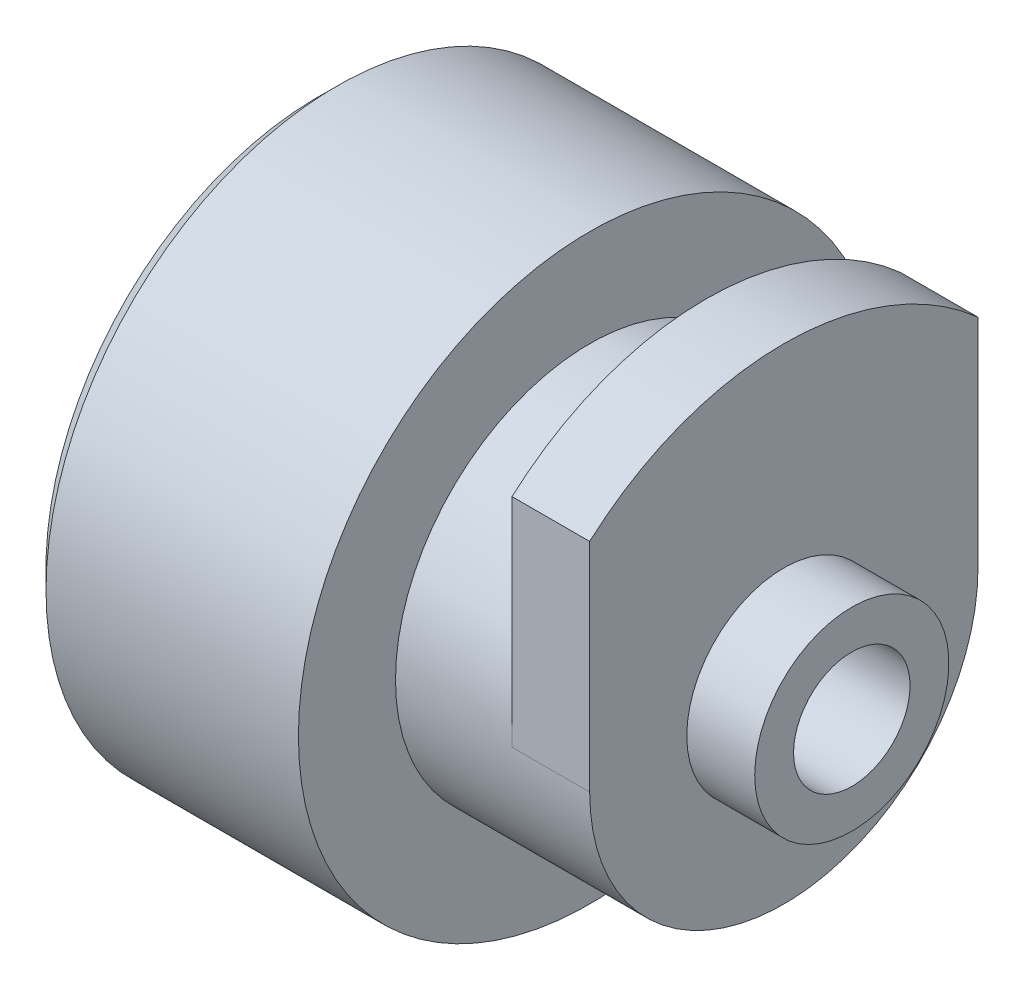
ISO-10303-21;
HEADER;
FILE_DESCRIPTION(('STEP AP214'),'2;1');
FILE_NAME('part.step','',(''),(''),'','','');
FILE_SCHEMA(('AUTOMOTIVE_DESIGN { 1 0 10303 214 1 1 1 1 }'));
ENDSEC;
DATA;
#1=APPLICATION_CONTEXT('core data for automotive mechanical design processes');
#2=APPLICATION_PROTOCOL_DEFINITION('international standard','automotive_design',2000,#1);
#3=PRODUCT_CONTEXT('',#1,'mechanical');
#4=PRODUCT('Part','Part','',(#3));
#5=PRODUCT_RELATED_PRODUCT_CATEGORY('part','',(#4));
#6=PRODUCT_DEFINITION_FORMATION('','',#4);
#7=PRODUCT_DEFINITION_CONTEXT('part definition',#1,'design');
#8=PRODUCT_DEFINITION('design','',#6,#7);
#9=PRODUCT_DEFINITION_SHAPE('','',#8);
#10=(LENGTH_UNIT() NAMED_UNIT(*) SI_UNIT(.MILLI.,.METRE.));
#11=(NAMED_UNIT(*) PLANE_ANGLE_UNIT() SI_UNIT($,.RADIAN.));
#12=(NAMED_UNIT(*) SI_UNIT($,.STERADIAN.) SOLID_ANGLE_UNIT());
#13=UNCERTAINTY_MEASURE_WITH_UNIT(LENGTH_MEASURE(1.E-05),#10,'distance_accuracy_value','');
#14=(GEOMETRIC_REPRESENTATION_CONTEXT(3) GLOBAL_UNCERTAINTY_ASSIGNED_CONTEXT((#13)) GLOBAL_UNIT_ASSIGNED_CONTEXT((#10,
#11,#12)) REPRESENTATION_CONTEXT('',''));
#15=CARTESIAN_POINT('',(0.,0.,0.));
#16=DIRECTION('',(0.,0.,1.));
#17=DIRECTION('',(1.,0.,0.));
#18=AXIS2_PLACEMENT_3D('',#15,#16,#17);
#19=CARTESIAN_POINT('',(0.,0.,-15.));
#20=DIRECTION('',(1.,0.,0.));
#21=DIRECTION('',(0.,0.,-1.));
#22=AXIS2_PLACEMENT_3D('',#19,#20,#21);
#23=PLANE('',#22);
#24=CARTESIAN_POINT('',(0.,0.,0.));
#25=DIRECTION('',(1.,0.,0.));
#26=DIRECTION('',(0.,0.,-1.));
#27=AXIS2_PLACEMENT_3D('',#24,#25,#26);
#28=CIRCLE('',#27,14.);
#29=CARTESIAN_POINT('',(0.,0.,-14.));
#30=VERTEX_POINT('',#29);
#31=EDGE_CURVE('E37',#30,#30,#28,.F.);
#32=ORIENTED_EDGE('',*,*,#31,.T.);
#33=EDGE_LOOP('',(#32));
#34=FACE_BOUND('',#33,.T.);
#35=CARTESIAN_POINT('',(0.,0.,0.));
#36=DIRECTION('',(-1.,0.,0.));
#37=DIRECTION('',(0.,0.,1.));
#38=AXIS2_PLACEMENT_3D('',#35,#36,#37);
#39=CIRCLE('',#38,10.);
#40=CARTESIAN_POINT('',(0.,0.,10.));
#41=VERTEX_POINT('',#40);
#42=EDGE_CURVE('E112',#41,#41,#39,.T.);
#43=ORIENTED_EDGE('',*,*,#42,.F.);
#44=EDGE_LOOP('',(#43));
#45=FACE_BOUND('',#44,.T.);
#46=ADVANCED_FACE('F30',(#34,#45),#23,.F.);
#47=CARTESIAN_POINT('',(0.,0.,0.));
#48=DIRECTION('',(-1.,0.,0.));
#49=DIRECTION('',(0.,0.,1.));
#50=AXIS2_PLACEMENT_3D('',#47,#48,#49);
#51=CYLINDRICAL_SURFACE('',#50,15.);
#52=CARTESIAN_POINT('',(1.00000000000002,0.,0.));
#53=DIRECTION('',(1.,0.,0.));
#54=DIRECTION('',(0.,0.,-1.));
#55=AXIS2_PLACEMENT_3D('',#52,#53,#54);
#56=CIRCLE('',#55,15.);
#57=CARTESIAN_POINT('',(1.00000000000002,0.,-15.));
#58=VERTEX_POINT('',#57);
#59=EDGE_CURVE('E11',#58,#58,#56,.T.);
#60=ORIENTED_EDGE('',*,*,#59,.T.);
#61=EDGE_LOOP('',(#60));
#62=FACE_BOUND('',#61,.T.);
#63=CARTESIAN_POINT('',(14.,0.,0.));
#64=DIRECTION('',(-1.,0.,0.));
#65=DIRECTION('',(0.,0.,1.));
#66=AXIS2_PLACEMENT_3D('',#63,#64,#65);
#67=CIRCLE('',#66,15.);
#68=CARTESIAN_POINT('',(14.,0.,15.));
#69=VERTEX_POINT('',#68);
#70=EDGE_CURVE('E125',#69,#69,#67,.T.);
#71=ORIENTED_EDGE('',*,*,#70,.T.);
#72=EDGE_LOOP('',(#71));
#73=FACE_BOUND('',#72,.T.);
#74=ADVANCED_FACE('F151',(#62,#73),#51,.T.);
#75=CARTESIAN_POINT('',(14.,0.,-9.99999999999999));
#76=DIRECTION('',(-1.,0.,0.));
#77=DIRECTION('',(0.,0.,1.));
#78=AXIS2_PLACEMENT_3D('',#75,#76,#77);
#79=PLANE('',#78);
#80=ORIENTED_EDGE('',*,*,#70,.F.);
#81=EDGE_LOOP('',(#80));
#82=FACE_BOUND('',#81,.T.);
#83=CARTESIAN_POINT('',(14.,0.,0.));
#84=DIRECTION('',(-1.,0.,0.));
#85=DIRECTION('',(0.,0.,1.));
#86=AXIS2_PLACEMENT_3D('',#83,#84,#85);
#87=CIRCLE('',#86,9.99999999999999);
#88=CARTESIAN_POINT('',(14.,0.,9.99999999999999));
#89=VERTEX_POINT('',#88);
#90=EDGE_CURVE('E77',#89,#89,#87,.T.);
#91=ORIENTED_EDGE('',*,*,#90,.T.);
#92=EDGE_LOOP('',(#91));
#93=FACE_BOUND('',#92,.T.);
#94=ADVANCED_FACE('F155',(#82,#93),#79,.F.);
#95=CARTESIAN_POINT('',(0.,0.,0.));
#96=DIRECTION('',(-1.,0.,0.));
#97=DIRECTION('',(0.,0.,1.));
#98=AXIS2_PLACEMENT_3D('',#95,#96,#97);
#99=CYLINDRICAL_SURFACE('',#98,9.99999999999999);
#100=ORIENTED_EDGE('',*,*,#90,.F.);
#101=EDGE_LOOP('',(#100));
#102=FACE_BOUND('',#101,.T.);
#103=CARTESIAN_POINT('',(20.,0.,0.));
#104=DIRECTION('',(1.,0.,0.));
#105=DIRECTION('',(0.,0.,-1.));
#106=AXIS2_PLACEMENT_3D('',#103,#104,#105);
#107=CIRCLE('',#106,9.99999999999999);
#108=CARTESIAN_POINT('',(20.,0.,-9.99999999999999));
#109=VERTEX_POINT('',#108);
#110=CARTESIAN_POINT('',(20.,0.,9.99999999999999));
#111=VERTEX_POINT('',#110);
#112=EDGE_CURVE('E48',#109,#111,#107,.T.);
#113=ORIENTED_EDGE('',*,*,#112,.F.);
#114=DIRECTION('',(1.,0.,0.));
#115=VECTOR('',#114,1.);
#116=CARTESIAN_POINT('',(20.,0.,-9.99999999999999));
#117=LINE('',#116,#115);
#118=CARTESIAN_POINT('',(24.,0.,-9.99999999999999));
#119=VERTEX_POINT('',#118);
#120=EDGE_CURVE('E80',#109,#119,#117,.T.);
#121=ORIENTED_EDGE('',*,*,#120,.T.);
#122=CARTESIAN_POINT('',(24.,0.,0.));
#123=DIRECTION('',(-1.,0.,0.));
#124=DIRECTION('',(0.,0.,1.));
#125=AXIS2_PLACEMENT_3D('',#122,#123,#124);
#126=CIRCLE('',#125,9.99999999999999);
#127=CARTESIAN_POINT('',(24.,0.,9.99999999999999));
#128=VERTEX_POINT('',#127);
#129=EDGE_CURVE('E69',#119,#128,#126,.T.);
#130=ORIENTED_EDGE('',*,*,#129,.T.);
#131=DIRECTION('',(1.,0.,0.));
#132=VECTOR('',#131,1.);
#133=CARTESIAN_POINT('',(20.,0.,9.99999999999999));
#134=LINE('',#133,#132);
#135=EDGE_CURVE('E44',#111,#128,#134,.T.);
#136=ORIENTED_EDGE('',*,*,#135,.F.);
#137=EDGE_LOOP('',(#113,#121,#130,#136));
#138=FACE_BOUND('',#137,.T.);
#139=ADVANCED_FACE('F81',(#102,#138),#99,.T.);
#140=CARTESIAN_POINT('',(24.,0.,-4.99999999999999));
#141=DIRECTION('',(-1.,0.,0.));
#142=DIRECTION('',(0.,0.,1.));
#143=AXIS2_PLACEMENT_3D('',#140,#141,#142);
#144=PLANE('',#143);
#145=CARTESIAN_POINT('',(24.,0.,0.));
#146=DIRECTION('',(-1.,0.,0.));
#147=DIRECTION('',(0.,0.,1.));
#148=AXIS2_PLACEMENT_3D('',#145,#146,#147);
#149=CIRCLE('',#148,4.99999999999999);
#150=CARTESIAN_POINT('',(24.,0.,4.99999999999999));
#151=VERTEX_POINT('',#150);
#152=EDGE_CURVE('E78',#151,#151,#149,.T.);
#153=ORIENTED_EDGE('',*,*,#152,.T.);
#154=EDGE_LOOP('',(#153));
#155=FACE_BOUND('',#154,.T.);
#156=ORIENTED_EDGE('',*,*,#129,.F.);
#157=DIRECTION('',(0.,1.,0.));
#158=VECTOR('',#157,1.);
#159=CARTESIAN_POINT('',(24.,0.,-9.99999999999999));
#160=LINE('',#159,#158);
#161=CARTESIAN_POINT('',(24.,11.180339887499,-9.99999999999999));
#162=VERTEX_POINT('',#161);
#163=EDGE_CURVE('E73',#119,#162,#160,.T.);
#164=ORIENTED_EDGE('',*,*,#163,.T.);
#165=CARTESIAN_POINT('',(24.,0.,0.));
#166=DIRECTION('',(1.,0.,0.));
#167=DIRECTION('',(0.,0.,-1.));
#168=AXIS2_PLACEMENT_3D('',#165,#166,#167);
#169=CIRCLE('',#168,15.);
#170=CARTESIAN_POINT('',(24.,11.1803398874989,9.99999999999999));
#171=VERTEX_POINT('',#170);
#172=EDGE_CURVE('E88',#162,#171,#169,.T.);
#173=ORIENTED_EDGE('',*,*,#172,.T.);
#174=DIRECTION('',(0.,-1.,0.));
#175=VECTOR('',#174,1.);
#176=CARTESIAN_POINT('',(24.,0.,9.99999999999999));
#177=LINE('',#176,#175);
#178=EDGE_CURVE('E76',#171,#128,#177,.T.);
#179=ORIENTED_EDGE('',*,*,#178,.T.);
#180=EDGE_LOOP('',(#156,#164,#173,#179));
#181=FACE_BOUND('',#180,.T.);
#182=ADVANCED_FACE('F70',(#155,#181),#144,.F.);
#183=CARTESIAN_POINT('',(0.,0.,0.));
#184=DIRECTION('',(-1.,0.,0.));
#185=DIRECTION('',(0.,0.,1.));
#186=AXIS2_PLACEMENT_3D('',#183,#184,#185);
#187=CYLINDRICAL_SURFACE('',#186,4.99999999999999);
#188=ORIENTED_EDGE('',*,*,#152,.F.);
#189=EDGE_LOOP('',(#188));
#190=FACE_BOUND('',#189,.T.);
#191=CARTESIAN_POINT('',(27.5,0.,0.));
#192=DIRECTION('',(-1.,0.,0.));
#193=DIRECTION('',(0.,0.,1.));
#194=AXIS2_PLACEMENT_3D('',#191,#192,#193);
#195=CIRCLE('',#194,4.99999999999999);
#196=CARTESIAN_POINT('',(27.5,0.,4.99999999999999));
#197=VERTEX_POINT('',#196);
#198=EDGE_CURVE('E118',#197,#197,#195,.T.);
#199=ORIENTED_EDGE('',*,*,#198,.T.);
#200=EDGE_LOOP('',(#199));
#201=FACE_BOUND('',#200,.T.);
#202=ADVANCED_FACE('F169',(#190,#201),#187,.T.);
#203=CARTESIAN_POINT('',(27.5,0.,0.));
#204=DIRECTION('',(-1.,0.,0.));
#205=DIRECTION('',(0.,0.,1.));
#206=AXIS2_PLACEMENT_3D('',#203,#204,#205);
#207=PLANE('',#206);
#208=CARTESIAN_POINT('',(27.5,0.,0.));
#209=DIRECTION('',(-1.,0.,0.));
#210=DIRECTION('',(0.,0.,1.));
#211=AXIS2_PLACEMENT_3D('',#208,#209,#210);
#212=CIRCLE('',#211,3.);
#213=CARTESIAN_POINT('',(27.5,0.,3.));
#214=VERTEX_POINT('',#213);
#215=EDGE_CURVE('E109',#214,#214,#212,.T.);
#216=ORIENTED_EDGE('',*,*,#215,.T.);
#217=EDGE_LOOP('',(#216));
#218=FACE_BOUND('',#217,.T.);
#219=ORIENTED_EDGE('',*,*,#198,.F.);
#220=EDGE_LOOP('',(#219));
#221=FACE_BOUND('',#220,.T.);
#222=ADVANCED_FACE('F173',(#218,#221),#207,.F.);
#223=CARTESIAN_POINT('',(5.,0.,0.));
#224=DIRECTION('',(-1.,0.,0.));
#225=DIRECTION('',(0.,0.,1.));
#226=AXIS2_PLACEMENT_3D('',#223,#224,#225);
#227=CYLINDRICAL_SURFACE('',#226,10.);
#228=CARTESIAN_POINT('',(5.,0.,0.));
#229=DIRECTION('',(-1.,0.,0.));
#230=DIRECTION('',(0.,0.,1.));
#231=AXIS2_PLACEMENT_3D('',#228,#229,#230);
#232=CIRCLE('',#231,10.);
#233=CARTESIAN_POINT('',(5.,0.,10.));
#234=VERTEX_POINT('',#233);
#235=EDGE_CURVE('E115',#234,#234,#232,.T.);
#236=ORIENTED_EDGE('',*,*,#235,.F.);
#237=EDGE_LOOP('',(#236));
#238=FACE_BOUND('',#237,.T.);
#239=ORIENTED_EDGE('',*,*,#42,.T.);
#240=EDGE_LOOP('',(#239));
#241=FACE_BOUND('',#240,.T.);
#242=ADVANCED_FACE('F177',(#238,#241),#227,.F.);
#243=CARTESIAN_POINT('',(5.,0.,0.));
#244=DIRECTION('',(-1.,0.,0.));
#245=DIRECTION('',(0.,0.,1.));
#246=AXIS2_PLACEMENT_3D('',#243,#244,#245);
#247=PLANE('',#246);
#248=CARTESIAN_POINT('',(5.,0.,0.));
#249=DIRECTION('',(-1.,0.,0.));
#250=DIRECTION('',(0.,0.,1.));
#251=AXIS2_PLACEMENT_3D('',#248,#249,#250);
#252=CIRCLE('',#251,3.);
#253=CARTESIAN_POINT('',(5.,0.,3.));
#254=VERTEX_POINT('',#253);
#255=EDGE_CURVE('E106',#254,#254,#252,.T.);
#256=ORIENTED_EDGE('',*,*,#255,.F.);
#257=EDGE_LOOP('',(#256));
#258=FACE_BOUND('',#257,.T.);
#259=ORIENTED_EDGE('',*,*,#235,.T.);
#260=EDGE_LOOP('',(#259));
#261=FACE_BOUND('',#260,.T.);
#262=ADVANCED_FACE('F145',(#258,#261),#247,.T.);
#263=CARTESIAN_POINT('',(27.5,0.,0.));
#264=DIRECTION('',(-1.,0.,0.));
#265=DIRECTION('',(0.,0.,1.));
#266=AXIS2_PLACEMENT_3D('',#263,#264,#265);
#267=CYLINDRICAL_SURFACE('',#266,3.);
#268=CARTESIAN_POINT('',(5.,0.,3.));
#269=CARTESIAN_POINT('',(5.234375,0.,3.));
#270=CARTESIAN_POINT('',(5.46875,0.,3.));
#271=CARTESIAN_POINT('',(5.9375,0.,3.));
#272=CARTESIAN_POINT('',(6.171875,0.,3.));
#273=CARTESIAN_POINT('',(6.640625,0.,3.));
#274=CARTESIAN_POINT('',(6.875,0.,3.));
#275=CARTESIAN_POINT('',(7.34375,0.,3.));
#276=CARTESIAN_POINT('',(7.578125,0.,3.));
#277=CARTESIAN_POINT('',(8.046875,0.,3.));
#278=CARTESIAN_POINT('',(8.28125,0.,3.));
#279=CARTESIAN_POINT('',(8.75,0.,3.));
#280=CARTESIAN_POINT('',(8.984375,0.,3.));
#281=CARTESIAN_POINT('',(9.453125,0.,3.));
#282=CARTESIAN_POINT('',(9.6875,0.,3.));
#283=CARTESIAN_POINT('',(10.15625,0.,3.));
#284=CARTESIAN_POINT('',(10.390625,0.,3.));
#285=CARTESIAN_POINT('',(10.859375,0.,3.));
#286=CARTESIAN_POINT('',(11.09375,0.,3.));
#287=CARTESIAN_POINT('',(11.5625,0.,3.));
#288=CARTESIAN_POINT('',(11.796875,0.,3.));
#289=CARTESIAN_POINT('',(12.265625,0.,3.));
#290=CARTESIAN_POINT('',(12.5,0.,3.));
#291=CARTESIAN_POINT('',(12.96875,0.,3.));
#292=CARTESIAN_POINT('',(13.203125,0.,3.));
#293=CARTESIAN_POINT('',(13.671875,0.,3.));
#294=CARTESIAN_POINT('',(13.90625,0.,3.));
#295=CARTESIAN_POINT('',(14.375,0.,3.));
#296=CARTESIAN_POINT('',(14.609375,0.,3.));
#297=CARTESIAN_POINT('',(15.078125,0.,3.));
#298=CARTESIAN_POINT('',(15.3125,0.,3.));
#299=CARTESIAN_POINT('',(15.78125,0.,3.));
#300=CARTESIAN_POINT('',(16.015625,0.,3.));
#301=CARTESIAN_POINT('',(16.484375,0.,3.));
#302=CARTESIAN_POINT('',(16.71875,0.,3.));
#303=CARTESIAN_POINT('',(17.1875,0.,3.));
#304=CARTESIAN_POINT('',(17.421875,0.,3.));
#305=CARTESIAN_POINT('',(17.890625,0.,3.));
#306=CARTESIAN_POINT('',(18.125,0.,3.));
#307=CARTESIAN_POINT('',(18.59375,0.,3.));
#308=CARTESIAN_POINT('',(18.828125,0.,3.));
#309=CARTESIAN_POINT('',(19.296875,0.,3.));
#310=CARTESIAN_POINT('',(19.53125,0.,3.));
#311=CARTESIAN_POINT('',(20.,0.,3.));
#312=CARTESIAN_POINT('',(20.234375,0.,3.));
#313=CARTESIAN_POINT('',(20.703125,0.,3.));
#314=CARTESIAN_POINT('',(20.9375,0.,3.));
#315=CARTESIAN_POINT('',(21.40625,0.,3.));
#316=CARTESIAN_POINT('',(21.640625,0.,3.));
#317=CARTESIAN_POINT('',(22.109375,0.,3.));
#318=CARTESIAN_POINT('',(22.34375,0.,3.));
#319=CARTESIAN_POINT('',(22.8125,0.,3.));
#320=CARTESIAN_POINT('',(23.046875,0.,3.));
#321=CARTESIAN_POINT('',(23.515625,0.,3.));
#322=CARTESIAN_POINT('',(23.75,0.,3.));
#323=CARTESIAN_POINT('',(24.21875,0.,3.));
#324=CARTESIAN_POINT('',(24.453125,0.,3.));
#325=CARTESIAN_POINT('',(24.921875,0.,3.));
#326=CARTESIAN_POINT('',(25.15625,0.,3.));
#327=CARTESIAN_POINT('',(25.625,0.,3.));
#328=CARTESIAN_POINT('',(25.859375,0.,3.));
#329=CARTESIAN_POINT('',(26.328125,0.,3.));
#330=CARTESIAN_POINT('',(26.5625,0.,3.));
#331=CARTESIAN_POINT('',(27.03125,0.,3.));
#332=CARTESIAN_POINT('',(27.265625,0.,3.));
#333=CARTESIAN_POINT('',(27.5,0.,3.));
#334=B_SPLINE_CURVE_WITH_KNOTS('',3,(#268,#269,#270,#271,#272,#273,#274,#275,#276,#277,#278,
#279,#280,#281,#282,#283,#284,#285,#286,#287,#288,#289,#290,#291,#292,#293,#294,#295,#296,#297,
#298,#299,#300,#301,#302,#303,#304,#305,#306,#307,#308,#309,#310,#311,#312,#313,#314,#315,#316,
#317,#318,#319,#320,#321,#322,#323,#324,#325,#326,#327,#328,#329,#330,#331,#332,#333),
.UNSPECIFIED.,.F.,.F.,(4,2,2,2,2,2,2,2,2,2,2,2,2,2,2,2,2,2,2,2,2,2,2,2,2,2,2,2,2,2,2,2,4),(0.,
0.703124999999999,1.40625,2.109375,2.8125,3.515625,4.21875,4.921875,5.625,6.328125,7.03125,
7.734375,8.4375,9.140625,9.84375,10.546875,11.25,11.953125,12.65625,13.359375,14.0625,14.765625,
15.46875,16.171875,16.875,17.578125,18.28125,18.984375,19.6875,20.390625,21.09375,21.796875,
22.5),.UNSPECIFIED.);
#335=EDGE_CURVE('BSEAM135',#254,#214,#334,.T.);
#336=ORIENTED_EDGE('',*,*,#255,.T.);
#337=ORIENTED_EDGE('',*,*,#215,.F.);
#338=ORIENTED_EDGE('',*,*,#335,.T.);
#339=ORIENTED_EDGE('',*,*,#335,.F.);
#340=EDGE_LOOP('',(#336,#338,#337,#339));
#341=FACE_BOUND('',#340,.T.);
#342=ADVANCED_FACE('F135',(#341),#267,.F.);
#343=CARTESIAN_POINT('',(0.,0.,0.));
#344=DIRECTION('',(1.,0.,0.));
#345=DIRECTION('',(0.,0.,-1.));
#346=AXIS2_PLACEMENT_3D('',#343,#344,#345);
#347=CONICAL_SURFACE('',#346,14.,0.785398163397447);
#348=ORIENTED_EDGE('',*,*,#59,.F.);
#349=EDGE_LOOP('',(#348));
#350=FACE_BOUND('',#349,.T.);
#351=ORIENTED_EDGE('',*,*,#31,.F.);
#352=EDGE_LOOP('',(#351));
#353=FACE_BOUND('',#352,.T.);
#354=ADVANCED_FACE('F132',(#350,#353),#347,.T.);
#355=CARTESIAN_POINT('',(20.,0.,0.));
#356=DIRECTION('',(1.,0.,0.));
#357=DIRECTION('',(0.,0.,-1.));
#358=AXIS2_PLACEMENT_3D('',#355,#356,#357);
#359=PLANE('',#358);
#360=DIRECTION('',(0.,1.,0.));
#361=VECTOR('',#360,1.);
#362=CARTESIAN_POINT('',(20.,0.,-9.99999999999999));
#363=LINE('',#362,#361);
#364=CARTESIAN_POINT('',(20.,11.180339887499,-9.99999999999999));
#365=VERTEX_POINT('',#364);
#366=EDGE_CURVE('E96',#109,#365,#363,.T.);
#367=ORIENTED_EDGE('',*,*,#366,.F.);
#368=ORIENTED_EDGE('',*,*,#112,.T.);
#369=DIRECTION('',(0.,-1.,0.));
#370=VECTOR('',#369,1.);
#371=CARTESIAN_POINT('',(20.,0.,9.99999999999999));
#372=LINE('',#371,#370);
#373=CARTESIAN_POINT('',(20.,11.1803398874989,9.99999999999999));
#374=VERTEX_POINT('',#373);
#375=EDGE_CURVE('E90',#374,#111,#372,.T.);
#376=ORIENTED_EDGE('',*,*,#375,.F.);
#377=CARTESIAN_POINT('',(20.,0.,0.));
#378=DIRECTION('',(1.,0.,0.));
#379=DIRECTION('',(0.,0.,-1.));
#380=AXIS2_PLACEMENT_3D('',#377,#378,#379);
#381=CIRCLE('',#380,15.);
#382=EDGE_CURVE('E98',#365,#374,#381,.T.);
#383=ORIENTED_EDGE('',*,*,#382,.F.);
#384=EDGE_LOOP('',(#367,#368,#376,#383));
#385=FACE_BOUND('',#384,.T.);
#386=ADVANCED_FACE('F134',(#385),#359,.F.);
#387=CARTESIAN_POINT('',(20.,0.,9.99999999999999));
#388=DIRECTION('',(0.,0.,1.));
#389=DIRECTION('',(1.,0.,0.));
#390=AXIS2_PLACEMENT_3D('',#387,#388,#389);
#391=PLANE('',#390);
#392=ORIENTED_EDGE('',*,*,#178,.F.);
#393=DIRECTION('',(1.,0.,0.));
#394=VECTOR('',#393,1.);
#395=CARTESIAN_POINT('',(20.,11.1803398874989,9.99999999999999));
#396=LINE('',#395,#394);
#397=EDGE_CURVE('E101',#374,#171,#396,.T.);
#398=ORIENTED_EDGE('',*,*,#397,.F.);
#399=ORIENTED_EDGE('',*,*,#375,.T.);
#400=ORIENTED_EDGE('',*,*,#135,.T.);
#401=EDGE_LOOP('',(#392,#398,#399,#400));
#402=FACE_BOUND('',#401,.T.);
#403=ADVANCED_FACE('F142',(#402),#391,.T.);
#404=CARTESIAN_POINT('',(20.,0.,0.));
#405=DIRECTION('',(1.,0.,0.));
#406=DIRECTION('',(0.,0.,-1.));
#407=AXIS2_PLACEMENT_3D('',#404,#405,#406);
#408=CYLINDRICAL_SURFACE('',#407,15.);
#409=ORIENTED_EDGE('',*,*,#172,.F.);
#410=DIRECTION('',(1.,0.,0.));
#411=VECTOR('',#410,1.);
#412=CARTESIAN_POINT('',(20.,11.180339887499,-9.99999999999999));
#413=LINE('',#412,#411);
#414=EDGE_CURVE('E85',#365,#162,#413,.T.);
#415=ORIENTED_EDGE('',*,*,#414,.F.);
#416=ORIENTED_EDGE('',*,*,#382,.T.);
#417=ORIENTED_EDGE('',*,*,#397,.T.);
#418=EDGE_LOOP('',(#409,#415,#416,#417));
#419=FACE_BOUND('',#418,.T.);
#420=ADVANCED_FACE('F224',(#419),#408,.T.);
#421=CARTESIAN_POINT('',(20.,0.,-9.99999999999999));
#422=DIRECTION('',(0.,0.,-1.));
#423=DIRECTION('',(-1.,0.,0.));
#424=AXIS2_PLACEMENT_3D('',#421,#422,#423);
#425=PLANE('',#424);
#426=ORIENTED_EDGE('',*,*,#163,.F.);
#427=ORIENTED_EDGE('',*,*,#120,.F.);
#428=ORIENTED_EDGE('',*,*,#366,.T.);
#429=ORIENTED_EDGE('',*,*,#414,.T.);
#430=EDGE_LOOP('',(#426,#427,#428,#429));
#431=FACE_BOUND('',#430,.T.);
#432=ADVANCED_FACE('F87',(#431),#425,.T.);
#433=CLOSED_SHELL('',(#46,#74,#94,#139,#182,#202,#222,#242,#262,#342,#354,#386,#403,#420,#432));
#434=MANIFOLD_SOLID_BREP('B2',#433);
#435=ADVANCED_BREP_SHAPE_REPRESENTATION('',(#18,#434),#14);
#436=SHAPE_DEFINITION_REPRESENTATION(#9,#435);
ENDSEC;
END-ISO-10303-21;
